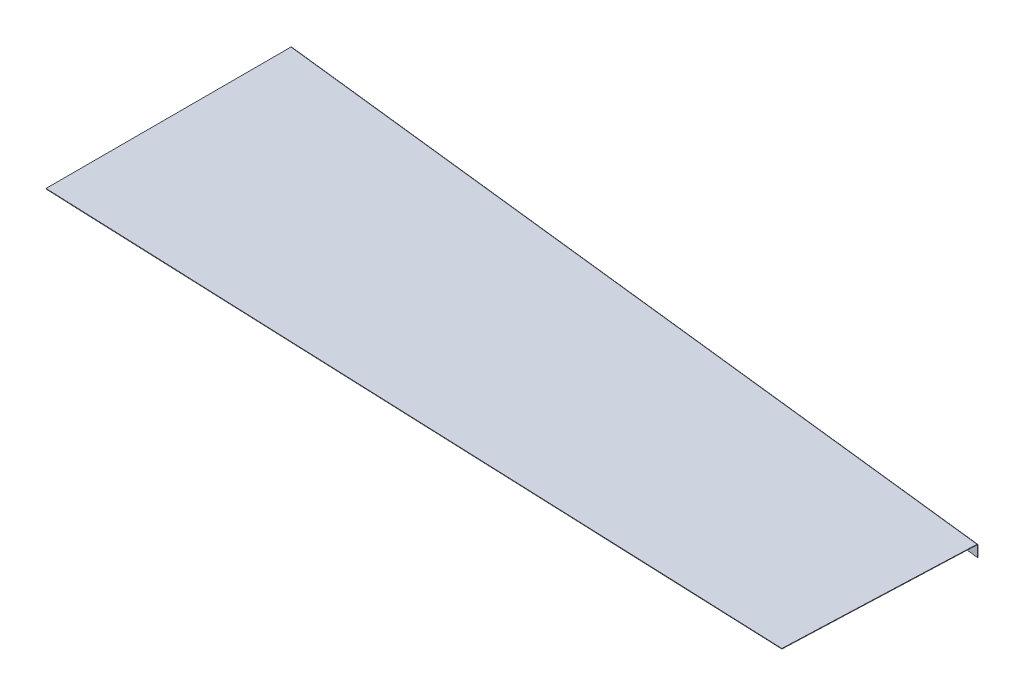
ISO-10303-21;
HEADER;
FILE_DESCRIPTION(('STEP AP214'),'2;1');
FILE_NAME('part.step','',(''),(''),'','','');
FILE_SCHEMA(('AUTOMOTIVE_DESIGN { 1 0 10303 214 1 1 1 1 }'));
ENDSEC;
DATA;
#1=APPLICATION_CONTEXT('core data for automotive mechanical design processes');
#2=APPLICATION_PROTOCOL_DEFINITION('international standard','automotive_design',2000,#1);
#3=PRODUCT_CONTEXT('',#1,'mechanical');
#4=PRODUCT('Part','Part','',(#3));
#5=PRODUCT_RELATED_PRODUCT_CATEGORY('part','',(#4));
#6=PRODUCT_DEFINITION_FORMATION('','',#4);
#7=PRODUCT_DEFINITION_CONTEXT('part definition',#1,'design');
#8=PRODUCT_DEFINITION('design','',#6,#7);
#9=PRODUCT_DEFINITION_SHAPE('','',#8);
#10=(LENGTH_UNIT() NAMED_UNIT(*) SI_UNIT(.MILLI.,.METRE.));
#11=(NAMED_UNIT(*) PLANE_ANGLE_UNIT() SI_UNIT($,.RADIAN.));
#12=(NAMED_UNIT(*) SI_UNIT($,.STERADIAN.) SOLID_ANGLE_UNIT());
#13=UNCERTAINTY_MEASURE_WITH_UNIT(LENGTH_MEASURE(1.E-05),#10,'distance_accuracy_value','');
#14=(GEOMETRIC_REPRESENTATION_CONTEXT(3) GLOBAL_UNCERTAINTY_ASSIGNED_CONTEXT((#13)) GLOBAL_UNIT_ASSIGNED_CONTEXT((#10,
#11,#12)) REPRESENTATION_CONTEXT('',''));
#15=CARTESIAN_POINT('',(0.,0.,0.));
#16=DIRECTION('',(0.,0.,1.));
#17=DIRECTION('',(1.,0.,0.));
#18=AXIS2_PLACEMENT_3D('',#15,#16,#17);
#19=CARTESIAN_POINT('',(-2552.7,3.23317196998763E-11,-1458.44736787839));
#20=DIRECTION('',(0.993648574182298,0.,0.11252782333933));
#21=DIRECTION('',(0.,-1.,0.));
#22=AXIS2_PLACEMENT_3D('',#19,#20,#21);
#23=PLANE('',#22);
#24=DIRECTION('',(-0.11252782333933,0.,0.993648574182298));
#25=VECTOR('',#24,1.);
#26=CARTESIAN_POINT('',(-2552.7,-3.25119999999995,-1458.44736787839));
#27=LINE('',#26,#25);
#28=CARTESIAN_POINT('',(-2552.51707477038,-3.25119999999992,-1460.06264300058));
#29=VERTEX_POINT('',#28);
#30=CARTESIAN_POINT('',(-2552.7,-3.25119999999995,-1458.44736787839));
#31=VERTEX_POINT('',#30);
#32=EDGE_CURVE('E12',#29,#31,#27,.T.);
#33=ORIENTED_EDGE('',*,*,#32,.F.);
#34=DIRECTION('',(0.,1.,0.));
#35=VECTOR('',#34,1.);
#36=CARTESIAN_POINT('',(-2552.51707477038,2.56378225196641E-11,-1460.06264300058));
#37=LINE('',#36,#35);
#38=CARTESIAN_POINT('',(-2552.51707477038,-38.1000000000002,-1460.06264300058));
#39=VERTEX_POINT('',#38);
#40=EDGE_CURVE('E240',#29,#39,#37,.F.);
#41=ORIENTED_EDGE('',*,*,#40,.T.);
#42=DIRECTION('',(-0.11252782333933,0.,0.993648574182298));
#43=VECTOR('',#42,1.);
#44=CARTESIAN_POINT('',(-2552.7,-38.1000000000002,-1458.44736787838));
#45=LINE('',#44,#43);
#46=CARTESIAN_POINT('',(-2552.7,-38.1000000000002,-1458.44736787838));
#47=VERTEX_POINT('',#46);
#48=EDGE_CURVE('E145',#39,#47,#45,.T.);
#49=ORIENTED_EDGE('',*,*,#48,.T.);
#50=DIRECTION('',(0.,-1.,0.));
#51=VECTOR('',#50,1.);
#52=CARTESIAN_POINT('',(-2552.7,3.23317196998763E-11,-1458.44736787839));
#53=LINE('',#52,#51);
#54=EDGE_CURVE('E267',#31,#47,#53,.T.);
#55=ORIENTED_EDGE('',*,*,#54,.F.);
#56=EDGE_LOOP('',(#33,#41,#49,#55));
#57=FACE_BOUND('',#56,.T.);
#58=ADVANCED_FACE('F132',(#57),#23,.F.);
#59=CARTESIAN_POINT('',(-32.7070283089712,-38.1,-1173.06546193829));
#60=DIRECTION('',(0.,1.,0.));
#61=DIRECTION('',(0.993648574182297,0.,0.11252782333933));
#62=AXIS2_PLACEMENT_3D('',#59,#60,#61);
#63=PLANE('',#62);
#64=ORIENTED_EDGE('',*,*,#48,.F.);
#65=DIRECTION('',(-0.993648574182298,0.,-0.11252782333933));
#66=VECTOR('',#65,1.);
#67=CARTESIAN_POINT('',(131.051556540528,-38.1000000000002,-1156.1562673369));
#68=LINE('',#67,#66);
#69=CARTESIAN_POINT('',(-32.5986075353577,-38.1,-1174.68917447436));
#70=VERTEX_POINT('',#69);
#71=EDGE_CURVE('E230',#39,#70,#68,.F.);
#72=ORIENTED_EDGE('',*,*,#71,.T.);
#73=DIRECTION('',(-0.11252782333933,0.,0.993648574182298));
#74=VECTOR('',#73,1.);
#75=CARTESIAN_POINT('',(-32.7815327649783,-38.1,-1173.07389935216));
#76=LINE('',#75,#74);
#77=CARTESIAN_POINT('',(-32.7815327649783,-38.1,-1173.07389935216));
#78=VERTEX_POINT('',#77);
#79=EDGE_CURVE('E260',#70,#78,#76,.T.);
#80=ORIENTED_EDGE('',*,*,#79,.T.);
#81=DIRECTION('',(0.993648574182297,0.,0.11252782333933));
#82=VECTOR('',#81,1.);
#83=CARTESIAN_POINT('',(-32.7070283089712,-38.1,-1173.06546193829));
#84=LINE('',#83,#82);
#85=EDGE_CURVE('E278',#47,#78,#84,.T.);
#86=ORIENTED_EDGE('',*,*,#85,.F.);
#87=EDGE_LOOP('',(#64,#72,#80,#86));
#88=FACE_BOUND('',#87,.T.);
#89=ADVANCED_FACE('F285',(#88),#63,.F.);
#90=CARTESIAN_POINT('',(-32.7815327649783,2.59067856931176E-11,-1173.07389935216));
#91=DIRECTION('',(0.993648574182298,0.,0.11252782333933));
#92=DIRECTION('',(0.,-1.,0.));
#93=AXIS2_PLACEMENT_3D('',#90,#91,#92);
#94=PLANE('',#93);
#95=ORIENTED_EDGE('',*,*,#79,.F.);
#96=DIRECTION('',(0.,1.,0.));
#97=VECTOR('',#96,1.);
#98=CARTESIAN_POINT('',(-32.5986075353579,2.56378225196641E-11,-1174.68917447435));
#99=LINE('',#98,#97);
#100=CARTESIAN_POINT('',(-32.5986075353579,-3.25119999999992,-1174.68917447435));
#101=VERTEX_POINT('',#100);
#102=EDGE_CURVE('E236',#101,#70,#99,.F.);
#103=ORIENTED_EDGE('',*,*,#102,.F.);
#104=DIRECTION('',(-0.112527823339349,0.,0.993648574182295));
#105=VECTOR('',#104,1.);
#106=CARTESIAN_POINT('',(-32.7815327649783,-3.25119999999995,-1173.07389935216));
#107=LINE('',#106,#105);
#108=CARTESIAN_POINT('',(-32.7815327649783,-3.25119999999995,-1173.07389935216));
#109=VERTEX_POINT('',#108);
#110=EDGE_CURVE('E256',#101,#109,#107,.T.);
#111=ORIENTED_EDGE('',*,*,#110,.T.);
#112=DIRECTION('',(0.,-1.,0.));
#113=VECTOR('',#112,1.);
#114=CARTESIAN_POINT('',(-32.7815327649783,2.59067856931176E-11,-1173.07389935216));
#115=LINE('',#114,#113);
#116=EDGE_CURVE('E283',#109,#78,#115,.T.);
#117=ORIENTED_EDGE('',*,*,#116,.T.);
#118=EDGE_LOOP('',(#95,#103,#111,#117));
#119=FACE_BOUND('',#118,.T.);
#120=ADVANCED_FACE('F319',(#119),#94,.T.);
#121=CARTESIAN_POINT('',(-33.0922941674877,-3.25119999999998,-1168.20111955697));
#122=CARTESIAN_POINT('',(-33.0313190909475,-3.25119999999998,-1168.7395445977));
#123=CARTESIAN_POINT('',(-32.9703440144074,-3.25119999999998,-1169.27796963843));
#124=CARTESIAN_POINT('',(-32.9093689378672,-3.25119999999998,-1169.81639467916));
#125=CARTESIAN_POINT('',(-33.0922941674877,-9.75359999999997,-1168.20111955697));
#126=CARTESIAN_POINT('',(-33.0313190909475,-8.66986666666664,-1168.7395445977));
#127=CARTESIAN_POINT('',(-32.9703440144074,-7.58613333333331,-1169.27796963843));
#128=CARTESIAN_POINT('',(-32.9093689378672,-6.50239999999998,-1169.81639467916));
#129=CARTESIAN_POINT('',(-32.5986075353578,-9.75359999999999,-1174.68917447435));
#130=CARTESIAN_POINT('',(-32.659582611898,-8.66986666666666,-1174.15074943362));
#131=CARTESIAN_POINT('',(-32.7205576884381,-7.58613333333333,-1173.61232439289));
#132=CARTESIAN_POINT('',(-32.7815327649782,-6.50239999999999,-1173.07389935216));
#133=CARTESIAN_POINT('',(-32.5986075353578,-3.2512,-1174.68917447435));
#134=CARTESIAN_POINT('',(-32.6595826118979,-3.2512,-1174.15074943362));
#135=CARTESIAN_POINT('',(-32.7205576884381,-3.25119999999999,-1173.61232439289));
#136=CARTESIAN_POINT('',(-32.7815327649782,-3.25119999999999,-1173.07389935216));
#137=CARTESIAN_POINT('',(-32.5986075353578,3.2512,-1174.68917447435));
#138=CARTESIAN_POINT('',(-32.659582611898,2.16746666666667,-1174.15074943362));
#139=CARTESIAN_POINT('',(-32.7205576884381,1.08373333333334,-1173.61232439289));
#140=CARTESIAN_POINT('',(-32.7815327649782,0.,-1173.07389935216));
#141=CARTESIAN_POINT('',(-33.0922941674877,3.25120000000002,-1168.20111955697));
#142=CARTESIAN_POINT('',(-33.0313190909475,2.16746666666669,-1168.7395445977));
#143=CARTESIAN_POINT('',(-32.9703440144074,1.08373333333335,-1169.27796963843));
#144=CARTESIAN_POINT('',(-32.9093689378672,0.,-1169.81639467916));
#145=CARTESIAN_POINT('',(-33.0922941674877,-3.25119999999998,-1168.20111955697));
#146=CARTESIAN_POINT('',(-33.0313190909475,-3.25119999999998,-1168.7395445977));
#147=CARTESIAN_POINT('',(-32.9703440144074,-3.25119999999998,-1169.27796963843));
#148=CARTESIAN_POINT('',(-32.9093689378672,-3.25119999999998,-1169.81639467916));
#149=(BOUNDED_SURFACE() B_SPLINE_SURFACE(3,3,((#121,#122,#123,#124),(#125,#126,#127,#128),(#129,
#130,#131,#132),(#133,#134,#135,#136),(#137,#138,#139,#140),(#141,#142,#143,#144),(#145,#146,
#147,#148)),.UNSPECIFIED.,.T.,.F.,.F.) B_SPLINE_SURFACE_WITH_KNOTS((4,3,4),(4,4),(0.,0.5,1.),
(0.,1.),.UNSPECIFIED.) GEOMETRIC_REPRESENTATION_ITEM() RATIONAL_B_SPLINE_SURFACE(((1.,1.,1.,1.),
(0.333333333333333,0.333333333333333,0.333333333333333,0.333333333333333),(0.333333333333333,
0.333333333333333,0.333333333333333,0.333333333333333),(1.,1.,1.,1.),(0.333333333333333,
0.333333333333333,0.333333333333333,0.333333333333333),(0.333333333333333,0.333333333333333,
0.333333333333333,0.333333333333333),(1.,1.,1.,1.))) REPRESENTATION_ITEM('') SURFACE());
#150=CARTESIAN_POINT('',(-32.8454508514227,-3.25119999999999,-1171.44514701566));
#151=DIRECTION('',(-0.997117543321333,0.,-0.0758722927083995));
#152=DIRECTION('',(-0.0758722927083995,0.,0.997117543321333));
#153=AXIS2_PLACEMENT_3D('',#150,#151,#152);
#154=ELLIPSE('',#153,3.25340525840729,3.2512);
#155=CARTESIAN_POINT('',(-32.8454508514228,0.,-1171.44514701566));
#156=VERTEX_POINT('',#155);
#157=EDGE_CURVE('E220',#101,#156,#154,.F.);
#158=DIRECTION('',(0.,-1.,0.));
#159=VECTOR('',#158,1.);
#160=CARTESIAN_POINT('',(-32.8454508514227,-1.6256,-1171.44514701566));
#161=LINE('',#160,#159);
#162=CARTESIAN_POINT('',(-32.8454508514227,-1.6256,-1171.44514701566));
#163=VERTEX_POINT('',#162);
#164=EDGE_CURVE('E153',#156,#163,#161,.T.);
#165=CARTESIAN_POINT('',(-32.8454508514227,-3.25119999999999,-1171.44514701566));
#166=DIRECTION('',(-0.999230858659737,0.,-0.0392134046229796));
#167=DIRECTION('',(-0.0392134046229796,0.,0.999230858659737));
#168=AXIS2_PLACEMENT_3D('',#165,#166,#167);
#169=ELLIPSE('',#168,1.6300060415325,1.6256);
#170=EDGE_CURVE('E314',#109,#163,#169,.F.);
#171=ORIENTED_EDGE('',*,*,#110,.F.);
#172=ORIENTED_EDGE('',*,*,#157,.T.);
#173=ORIENTED_EDGE('',*,*,#164,.T.);
#174=ORIENTED_EDGE('',*,*,#170,.F.);
#175=EDGE_LOOP('',(#171,#172,#173,#174));
#176=FACE_BOUND('',#175,.T.);
#177=ADVANCED_FACE('F326',(#176),#149,.T.);
#178=CARTESIAN_POINT('',(-32.7177874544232,-1.6256,-1174.698249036));
#179=DIRECTION('',(0.999230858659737,0.,0.0392134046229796));
#180=DIRECTION('',(0.0392134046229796,0.,-0.999230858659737));
#181=AXIS2_PLACEMENT_3D('',#178,#179,#180);
#182=PLANE('',#181);
#183=ORIENTED_EDGE('',*,*,#164,.F.);
#184=DIRECTION('',(0.0392134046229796,0.,-0.999230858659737));
#185=VECTOR('',#184,1.);
#186=CARTESIAN_POINT('',(-32.7177874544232,0.,-1174.698249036));
#187=LINE('',#186,#185);
#188=CARTESIAN_POINT('',(-56.8344125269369,0.,-560.161556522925));
#189=VERTEX_POINT('',#188);
#190=EDGE_CURVE('E210',#189,#156,#187,.T.);
#191=ORIENTED_EDGE('',*,*,#190,.F.);
#192=DIRECTION('',(0.,-1.,0.));
#193=VECTOR('',#192,1.);
#194=CARTESIAN_POINT('',(-56.8344125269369,-1.62559999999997,-560.161556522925));
#195=LINE('',#194,#193);
#196=CARTESIAN_POINT('',(-56.8344125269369,-1.62559999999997,-560.161556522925));
#197=VERTEX_POINT('',#196);
#198=EDGE_CURVE('E248',#189,#197,#195,.T.);
#199=ORIENTED_EDGE('',*,*,#198,.T.);
#200=DIRECTION('',(0.0392134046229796,0.,-0.999230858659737));
#201=VECTOR('',#200,1.);
#202=CARTESIAN_POINT('',(-32.7177874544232,-1.6256,-1174.698249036));
#203=LINE('',#202,#201);
#204=EDGE_CURVE('E301',#197,#163,#203,.T.);
#205=ORIENTED_EDGE('',*,*,#204,.T.);
#206=EDGE_LOOP('',(#183,#191,#199,#205));
#207=FACE_BOUND('',#206,.T.);
#208=ADVANCED_FACE('F337',(#207),#182,.T.);
#209=CARTESIAN_POINT('',(-56.8344125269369,-1.62559999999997,-560.161556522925));
#210=DIRECTION('',(-0.0396940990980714,0.,0.999211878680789));
#211=DIRECTION('',(0.999211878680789,0.,0.0396940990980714));
#212=AXIS2_PLACEMENT_3D('',#209,#210,#211);
#213=PLANE('',#212);
#214=ORIENTED_EDGE('',*,*,#198,.F.);
#215=DIRECTION('',(0.999211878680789,0.,0.0396940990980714));
#216=VECTOR('',#215,1.);
#217=CARTESIAN_POINT('',(-56.8344125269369,0.,-560.161556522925));
#218=LINE('',#217,#216);
#219=CARTESIAN_POINT('',(-2552.7,0.,-659.310834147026));
#220=VERTEX_POINT('',#219);
#221=EDGE_CURVE('E225',#220,#189,#218,.T.);
#222=ORIENTED_EDGE('',*,*,#221,.F.);
#223=DIRECTION('',(0.,-1.,0.));
#224=VECTOR('',#223,1.);
#225=CARTESIAN_POINT('',(-2552.7,-1.62560000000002,-659.310834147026));
#226=LINE('',#225,#224);
#227=CARTESIAN_POINT('',(-2552.7,-1.62560000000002,-659.310834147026));
#228=VERTEX_POINT('',#227);
#229=EDGE_CURVE('E198',#220,#228,#226,.T.);
#230=ORIENTED_EDGE('',*,*,#229,.T.);
#231=DIRECTION('',(0.999211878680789,0.,0.0396940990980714));
#232=VECTOR('',#231,1.);
#233=CARTESIAN_POINT('',(-56.8344125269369,-1.62559999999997,-560.161556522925));
#234=LINE('',#233,#232);
#235=EDGE_CURVE('E287',#228,#197,#234,.T.);
#236=ORIENTED_EDGE('',*,*,#235,.T.);
#237=EDGE_LOOP('',(#214,#222,#230,#236));
#238=FACE_BOUND('',#237,.T.);
#239=ADVANCED_FACE('F332',(#238),#213,.T.);
#240=CARTESIAN_POINT('',(-2552.7,-1.62559999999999,-3.38007155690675E-12));
#241=DIRECTION('',(1.,0.,0.));
#242=DIRECTION('',(0.,0.,-1.));
#243=AXIS2_PLACEMENT_3D('',#240,#241,#242);
#244=PLANE('',#243);
#245=ORIENTED_EDGE('',*,*,#229,.F.);
#246=DIRECTION('',(0.,0.,1.));
#247=VECTOR('',#246,1.);
#248=CARTESIAN_POINT('',(-2552.7,0.,0.));
#249=LINE('',#248,#247);
#250=CARTESIAN_POINT('',(-2552.7,0.,-1456.81137700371));
#251=VERTEX_POINT('',#250);
#252=EDGE_CURVE('E207',#220,#251,#249,.F.);
#253=ORIENTED_EDGE('',*,*,#252,.T.);
#254=DIRECTION('',(-2.73184799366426E-13,-1.,0.));
#255=VECTOR('',#254,1.);
#256=CARTESIAN_POINT('',(-2552.7,-1.62559999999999,-1456.81137700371));
#257=LINE('',#256,#255);
#258=CARTESIAN_POINT('',(-2552.7,-1.62559999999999,-1456.81137700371));
#259=VERTEX_POINT('',#258);
#260=EDGE_CURVE('E138',#251,#259,#257,.T.);
#261=ORIENTED_EDGE('',*,*,#260,.T.);
#262=DIRECTION('',(0.,0.,-1.));
#263=VECTOR('',#262,1.);
#264=CARTESIAN_POINT('',(-2552.7,-1.62559999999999,-3.38007155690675E-12));
#265=LINE('',#264,#263);
#266=EDGE_CURVE('E291',#228,#259,#265,.T.);
#267=ORIENTED_EDGE('',*,*,#266,.F.);
#268=EDGE_LOOP('',(#245,#253,#261,#267));
#269=FACE_BOUND('',#268,.T.);
#270=ADVANCED_FACE('F222',(#269),#244,.F.);
#271=CARTESIAN_POINT('',(-2552.88292522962,-3.25119999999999,-1453.56011100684));
#272=CARTESIAN_POINT('',(-2552.82195015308,-3.25119999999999,-1454.09853604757));
#273=CARTESIAN_POINT('',(-2552.76097507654,-3.25119999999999,-1454.6369610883));
#274=CARTESIAN_POINT('',(-2552.7,-3.25119999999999,-1455.17538612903));
#275=CARTESIAN_POINT('',(-2552.88292522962,3.25120000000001,-1453.56011100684));
#276=CARTESIAN_POINT('',(-2552.82195015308,2.16746666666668,-1454.09853604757));
#277=CARTESIAN_POINT('',(-2552.76097507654,1.08373333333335,-1454.6369610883));
#278=CARTESIAN_POINT('',(-2552.7,0.,-1455.17538612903));
#279=CARTESIAN_POINT('',(-2552.51707477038,3.25120000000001,-1460.06264300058));
#280=CARTESIAN_POINT('',(-2552.57804984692,2.16746666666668,-1459.52421795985));
#281=CARTESIAN_POINT('',(-2552.63902492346,1.08373333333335,-1458.98579291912));
#282=CARTESIAN_POINT('',(-2552.7,0.,-1458.44736787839));
#283=CARTESIAN_POINT('',(-2552.51707477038,-3.25119999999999,-1460.06264300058));
#284=CARTESIAN_POINT('',(-2552.57804984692,-3.25119999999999,-1459.52421795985));
#285=CARTESIAN_POINT('',(-2552.63902492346,-3.25119999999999,-1458.98579291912));
#286=CARTESIAN_POINT('',(-2552.7,-3.25119999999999,-1458.44736787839));
#287=CARTESIAN_POINT('',(-2552.51707477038,-9.75359999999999,-1460.06264300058));
#288=CARTESIAN_POINT('',(-2552.57804984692,-8.66986666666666,-1459.52421795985));
#289=CARTESIAN_POINT('',(-2552.63902492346,-7.58613333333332,-1458.98579291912));
#290=CARTESIAN_POINT('',(-2552.7,-6.50239999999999,-1458.44736787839));
#291=CARTESIAN_POINT('',(-2552.88292522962,-9.75359999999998,-1453.56011100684));
#292=CARTESIAN_POINT('',(-2552.82195015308,-8.66986666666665,-1454.09853604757));
#293=CARTESIAN_POINT('',(-2552.76097507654,-7.58613333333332,-1454.6369610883));
#294=CARTESIAN_POINT('',(-2552.7,-6.50239999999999,-1455.17538612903));
#295=CARTESIAN_POINT('',(-2552.88292522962,-3.25119999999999,-1453.56011100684));
#296=CARTESIAN_POINT('',(-2552.82195015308,-3.25119999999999,-1454.09853604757));
#297=CARTESIAN_POINT('',(-2552.76097507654,-3.25119999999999,-1454.6369610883));
#298=CARTESIAN_POINT('',(-2552.7,-3.25119999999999,-1455.17538612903));
#299=(BOUNDED_SURFACE() B_SPLINE_SURFACE(3,3,((#271,#272,#273,#274),(#275,#276,#277,#278),(#279,
#280,#281,#282),(#283,#284,#285,#286),(#287,#288,#289,#290),(#291,#292,#293,#294),(#295,#296,
#297,#298)),.UNSPECIFIED.,.T.,.F.,.F.) B_SPLINE_SURFACE_WITH_KNOTS((4,3,4),(4,4),(0.,0.5,1.),
(0.,1.),.UNSPECIFIED.) GEOMETRIC_REPRESENTATION_ITEM() RATIONAL_B_SPLINE_SURFACE(((1.,1.,1.,1.),
(0.333333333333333,0.333333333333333,0.333333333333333,0.333333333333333),(0.333333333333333,
0.333333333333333,0.333333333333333,0.333333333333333),(1.,1.,1.,1.),(0.333333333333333,
0.333333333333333,0.333333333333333,0.333333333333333),(0.333333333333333,0.333333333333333,
0.333333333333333,0.333333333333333),(1.,1.,1.,1.))) REPRESENTATION_ITEM('') SURFACE());
#300=CARTESIAN_POINT('',(-2552.7,-3.25119999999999,-1456.81137700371));
#301=DIRECTION('',(0.99842099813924,0.,0.0561739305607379));
#302=DIRECTION('',(-0.0561739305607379,0.,0.99842099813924));
#303=AXIS2_PLACEMENT_3D('',#300,#301,#302);
#304=ELLIPSE('',#303,3.25640787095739,3.2512);
#305=EDGE_CURVE('E189',#251,#29,#304,.F.);
#306=CARTESIAN_POINT('',(-2552.7,-3.25119999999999,-1456.81137700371));
#307=DIRECTION('',(1.,0.,0.));
#308=DIRECTION('',(0.,0.,1.));
#309=AXIS2_PLACEMENT_3D('',#306,#307,#308);
#310=ELLIPSE('',#309,1.63599087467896,1.6256);
#311=EDGE_CURVE('E191',#259,#31,#310,.F.);
#312=ORIENTED_EDGE('',*,*,#305,.T.);
#313=ORIENTED_EDGE('',*,*,#32,.T.);
#314=ORIENTED_EDGE('',*,*,#311,.F.);
#315=ORIENTED_EDGE('',*,*,#260,.F.);
#316=EDGE_LOOP('',(#312,#313,#314,#315));
#317=FACE_BOUND('',#316,.T.);
#318=ADVANCED_FACE('F134',(#317),#299,.T.);
#319=CARTESIAN_POINT('',(0.,-1.62559999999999,0.));
#320=DIRECTION('',(0.,1.,0.));
#321=DIRECTION('',(0.,0.,1.));
#322=AXIS2_PLACEMENT_3D('',#319,#320,#321);
#323=PLANE('',#322);
#324=ORIENTED_EDGE('',*,*,#266,.T.);
#325=DIRECTION('',(-0.993648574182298,0.,-0.11252782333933));
#326=VECTOR('',#325,1.);
#327=CARTESIAN_POINT('',(-32.9644579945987,-1.62559999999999,-1171.45862422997));
#328=LINE('',#327,#326);
#329=EDGE_CURVE('E199',#259,#163,#328,.F.);
#330=ORIENTED_EDGE('',*,*,#329,.T.);
#331=ORIENTED_EDGE('',*,*,#204,.F.);
#332=ORIENTED_EDGE('',*,*,#235,.F.);
#333=EDGE_LOOP('',(#324,#330,#331,#332));
#334=FACE_BOUND('',#333,.T.);
#335=ADVANCED_FACE('F335',(#334),#323,.F.);
#336=CARTESIAN_POINT('',(130.868631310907,2.56020540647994E-11,-1154.54099221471));
#337=DIRECTION('',(0.11252782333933,0.,-0.993648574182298));
#338=DIRECTION('',(-0.993648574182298,0.,-0.11252782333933));
#339=AXIS2_PLACEMENT_3D('',#336,#337,#338);
#340=PLANE('',#339);
#341=ORIENTED_EDGE('',*,*,#116,.F.);
#342=DIRECTION('',(-0.993648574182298,0.,-0.11252782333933));
#343=VECTOR('',#342,1.);
#344=CARTESIAN_POINT('',(-2552.7,-3.25119999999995,-1458.44736787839));
#345=LINE('',#344,#343);
#346=EDGE_CURVE('E281',#109,#31,#345,.T.);
#347=ORIENTED_EDGE('',*,*,#346,.T.);
#348=ORIENTED_EDGE('',*,*,#54,.T.);
#349=ORIENTED_EDGE('',*,*,#85,.T.);
#350=EDGE_LOOP('',(#341,#347,#348,#349));
#351=FACE_BOUND('',#350,.T.);
#352=ADVANCED_FACE('F277',(#351),#340,.F.);
#353=CARTESIAN_POINT('',(130.685706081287,-3.25119999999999,-1152.92571709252));
#354=DIRECTION('',(0.993648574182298,0.,0.11252782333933));
#355=DIRECTION('',(0.11252782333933,0.,-0.993648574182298));
#356=AXIS2_PLACEMENT_3D('',#353,#354,#355);
#357=CYLINDRICAL_SURFACE('',#356,1.6256);
#358=ORIENTED_EDGE('',*,*,#170,.T.);
#359=ORIENTED_EDGE('',*,*,#329,.F.);
#360=ORIENTED_EDGE('',*,*,#311,.T.);
#361=ORIENTED_EDGE('',*,*,#346,.F.);
#362=EDGE_LOOP('',(#358,#359,#360,#361));
#363=FACE_BOUND('',#362,.T.);
#364=ADVANCED_FACE('F327',(#363),#357,.F.);
#365=CARTESIAN_POINT('',(0.,0.,0.));
#366=DIRECTION('',(0.,1.,0.));
#367=DIRECTION('',(0.,0.,1.));
#368=AXIS2_PLACEMENT_3D('',#365,#366,#367);
#369=PLANE('',#368);
#370=ORIENTED_EDGE('',*,*,#252,.F.);
#371=ORIENTED_EDGE('',*,*,#221,.T.);
#372=ORIENTED_EDGE('',*,*,#190,.T.);
#373=DIRECTION('',(0.993648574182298,0.,0.11252782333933));
#374=VECTOR('',#373,1.);
#375=CARTESIAN_POINT('',(130.685706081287,0.,-1152.92571709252));
#376=LINE('',#375,#374);
#377=EDGE_CURVE('E204',#251,#156,#376,.T.);
#378=ORIENTED_EDGE('',*,*,#377,.F.);
#379=EDGE_LOOP('',(#370,#371,#372,#378));
#380=FACE_BOUND('',#379,.T.);
#381=ADVANCED_FACE('F205',(#380),#369,.T.);
#382=CARTESIAN_POINT('',(131.051556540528,2.56378225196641E-11,-1156.1562673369));
#383=DIRECTION('',(0.11252782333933,0.,-0.993648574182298));
#384=DIRECTION('',(-0.993648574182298,0.,-0.11252782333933));
#385=AXIS2_PLACEMENT_3D('',#382,#383,#384);
#386=PLANE('',#385);
#387=ORIENTED_EDGE('',*,*,#102,.T.);
#388=ORIENTED_EDGE('',*,*,#71,.F.);
#389=ORIENTED_EDGE('',*,*,#40,.F.);
#390=DIRECTION('',(-0.993648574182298,0.,-0.11252782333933));
#391=VECTOR('',#390,1.);
#392=CARTESIAN_POINT('',(131.051556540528,-3.25119999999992,-1156.1562673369));
#393=LINE('',#392,#391);
#394=EDGE_CURVE('E214',#101,#29,#393,.T.);
#395=ORIENTED_EDGE('',*,*,#394,.F.);
#396=EDGE_LOOP('',(#387,#388,#389,#395));
#397=FACE_BOUND('',#396,.T.);
#398=ADVANCED_FACE('F441',(#397),#386,.T.);
#399=CARTESIAN_POINT('',(130.685706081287,-3.25119999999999,-1152.92571709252));
#400=DIRECTION('',(0.993648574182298,0.,0.11252782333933));
#401=DIRECTION('',(0.11252782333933,0.,-0.993648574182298));
#402=AXIS2_PLACEMENT_3D('',#399,#400,#401);
#403=CYLINDRICAL_SURFACE('',#402,3.2512);
#404=ORIENTED_EDGE('',*,*,#157,.F.);
#405=ORIENTED_EDGE('',*,*,#394,.T.);
#406=ORIENTED_EDGE('',*,*,#305,.F.);
#407=ORIENTED_EDGE('',*,*,#377,.T.);
#408=EDGE_LOOP('',(#404,#405,#406,#407));
#409=FACE_BOUND('',#408,.T.);
#410=ADVANCED_FACE('F216',(#409),#403,.T.);
#411=CLOSED_SHELL('',(#58,#89,#120,#177,#208,#239,#270,#318,#335,#352,#364,#381,#398,#410));
#412=MANIFOLD_SOLID_BREP('B2',#411);
#413=ADVANCED_BREP_SHAPE_REPRESENTATION('',(#18,#412),#14);
#414=SHAPE_DEFINITION_REPRESENTATION(#9,#413);
ENDSEC;
END-ISO-10303-21;
